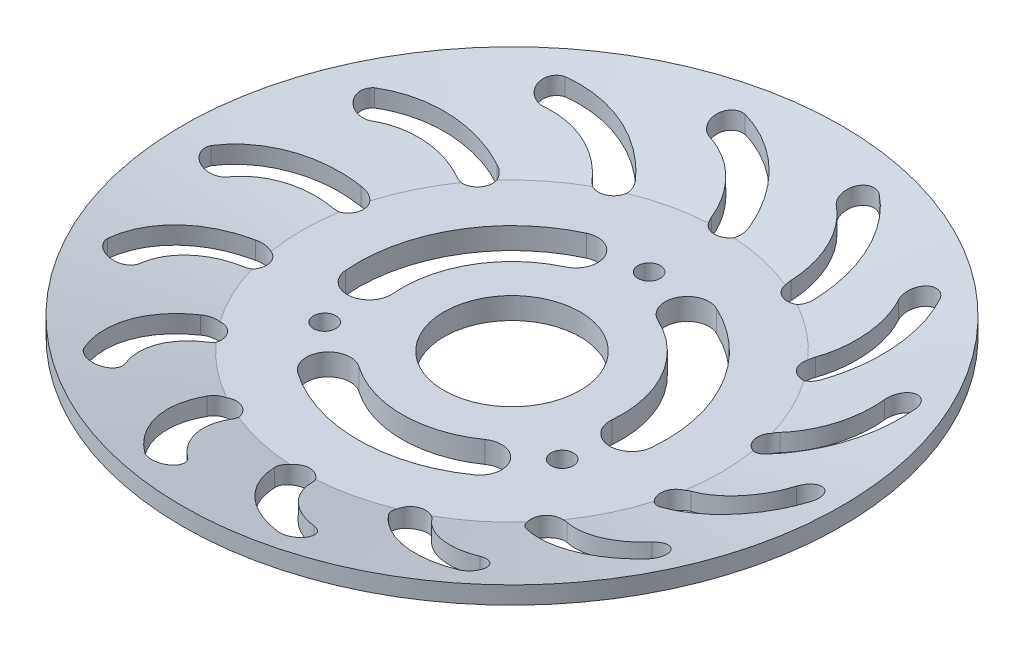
from build123d import *

# Parameters (mm, degrees)
SKETCH1_R           = 95.25
BOSS_EXTRUDE1_DEPTH = 15.08125
CUT_EXTRUDE1_REACH  = 137.545
SKETCH3_R           = 19.685
CUT_EXTRUDE2_REACH  = 136.993
SKETCH4_R           = 3.2385
CIRPATTERN1_COUNT   = 3
CUT_EXTRUDE3_REACH  = 136.993
CIRPATTERN3_COUNT   = 3
CUT_EXTRUDE4_START  = -8.834782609
SKETCH9_R           = 28.829
CUT_EXTRUDE4_DEPTH  = 8.834782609
CUT_EXTRUDE5_DEPTH  = 136.545450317
CIRPATTERN4_COUNT   = 14


with BuildPart() as part:
    # Sketch1 → Boss-Extrude1 (new body)
    with BuildSketch(Plane(origin=(0, 0, 0), x_dir=(1, 0, 0), z_dir=(0, 1, 0))):
        with Locations(Location((0, 0, 0), (0, 0, 90))):
            Circle(SKETCH1_R)
    extrude(amount=BOSS_EXTRUDE1_DEPTH)

    # Sketch2 → Cut-Revolve1 (revolve, cut)
    with BuildSketch(Plane.XY, mode=Mode.PRIVATE) as cut_revolve1_sk:
        Polygon((95.25, 15.08125), (28.829, 15.08125), (28.829, 6.246467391), (60.579, 6.246467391), align=None)
        Polygon((95.25, 0), (95.25, 10.00125), (56.001344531, 0), align=None)
    revolve(cut_revolve1_sk.sketch.rotate(Axis((0, 0, 0), (0, 1, 0)), 90), axis=Axis((0, 0, 0), (0, 1, 0)), mode=Mode.SUBTRACT)

    # Sketch3 → Cut-Extrude1 (cut, up to next)
    with BuildSketch(Plane(origin=(0, 15.08125, 0), x_dir=(1, 0, 0), z_dir=(0, 1, 0)), mode=Mode.PRIVATE) as cut_extrude1_sk1:
        with Locations(Location((0, 0, 0), (0, 0, 270))):
            Circle(SKETCH3_R)
    cut_extrude1_tool1 = extrude(cut_extrude1_sk1.sketch, amount=-CUT_EXTRUDE1_REACH, mode=Mode.PRIVATE) & part.part
    add(cut_extrude1_tool1.solids().sort_by_distance((0, 15.08125, 0))[0], mode=Mode.SUBTRACT)

    # Sketch4 → Cut-Extrude2 (cut, up to next)
    with BuildSketch(Plane(origin=(0, 6.246467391, 0), x_dir=(1, 0, 0), z_dir=(0, 1, 0)), mode=Mode.PRIVATE) as cut_extrude2_sk1:
        with Locations(Location((0, 39.63416, 0), (0, 0, 270))):
            Circle(SKETCH4_R)
    cut_extrude2_tool1 = extrude(cut_extrude2_sk1.sketch, amount=-CUT_EXTRUDE2_REACH, mode=Mode.PRIVATE) & part.part
    cut_extrude2 = cut_extrude2_tool1.solids().sort_by_distance((0, 6.246467, -39.63416))[0]
    add(cut_extrude2, mode=Mode.SUBTRACT)

    # CirPattern1: Cut-Extrude2 ×3 about axis
    cirpattern1_axis = Axis((0, 0, 0), (0, 1, 0))
    for i in range(1, CIRPATTERN1_COUNT):
        add(cut_extrude2.rotate(cirpattern1_axis, i * 360 / CIRPATTERN1_COUNT), mode=Mode.SUBTRACT)

    # Sketch8 → Cut-Extrude3 (cut, up to next)
    with BuildSketch(Plane(origin=(0, 6.246467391, 0), x_dir=(1, 0, 0), z_dir=(0, 1, 0)), mode=Mode.PRIVATE) as cut_extrude3_sk1:
        with BuildLine():
            ThreePointArc((44.28085433, -3.874072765), (38.494829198, 22.225), (18.785381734, 40.285381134))
            ThreePointArc((18.785381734, 40.285381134), (10.346701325, 37.213952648), (13.41812981, 28.775272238))
            ThreePointArc((13.41812981, 28.775272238), (27.49630657, 15.875), (31.629181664, -2.767194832))
            ThreePointArc((31.629181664, -2.767194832), (37.401579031, -9.646470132), (44.28085433, -3.874072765))
        make_face()
    cut_extrude3_tool1 = extrude(cut_extrude3_sk1.sketch, amount=-CUT_EXTRUDE3_REACH, mode=Mode.PRIVATE) & part.part
    cut_extrude3 = cut_extrude3_tool1.solids().sort_by_distance((30.283836, 6.246467, -17.484381))[0]
    add(cut_extrude3, mode=Mode.SUBTRACT)

    # CirPattern3: Cut-Extrude3 ×3 about axis
    cirpattern3_axis = Axis((0, 0, 0), (0, 1, 0))
    for i in range(1, CIRPATTERN3_COUNT):
        add(cut_extrude3.rotate(cirpattern3_axis, i * 360 / CIRPATTERN3_COUNT), mode=Mode.SUBTRACT)

    # Sketch9 → Cut-Extrude4 (cut)
    with BuildSketch(Plane(origin=(0, 15.08125, 0), x_dir=(1, 0, 0), z_dir=(0, 1, 0)).offset(CUT_EXTRUDE4_START)):
        Circle(SKETCH9_R)
    extrude(amount=CUT_EXTRUDE4_DEPTH, mode=Mode.SUBTRACT)

    # Sketch7 → Cut-Extrude5 (cut, through all)
    with BuildSketch(Plane(origin=(0, 15.08125, 0), x_dir=(-1, 0, 0), z_dir=(0, 1, 0))):
        with BuildLine():
            ThreePointArc((-18.583595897, 85.992767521), (-23.430029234, 82.329515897), (-20.094714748, 77.251818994))
            ThreePointArc((-20.094714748, 77.251818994), (-10.046293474, 71.834844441), (-4.32776372, 61.954925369))
            ThreePointArc((-4.32776372, 61.954925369), (1.297635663, 58.717696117), (4.156432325, 64.544535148))
            ThreePointArc((4.156432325, 64.544535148), (-4.17804654, 78.487012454), (-18.583595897, 85.992767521))
        make_face()
    cut_extrude5 = extrude(amount=-CUT_EXTRUDE5_DEPTH, mode=Mode.SUBTRACT)

    # CirPattern4: Cut-Extrude5 ×14 about axis
    cirpattern4_axis = Axis((0, 0, 0), (0, 1, 0))
    for i in range(1, CIRPATTERN4_COUNT):
        add(cut_extrude5.rotate(cirpattern4_axis, i * 360 / CIRPATTERN4_COUNT), mode=Mode.SUBTRACT)


solid = part.part
